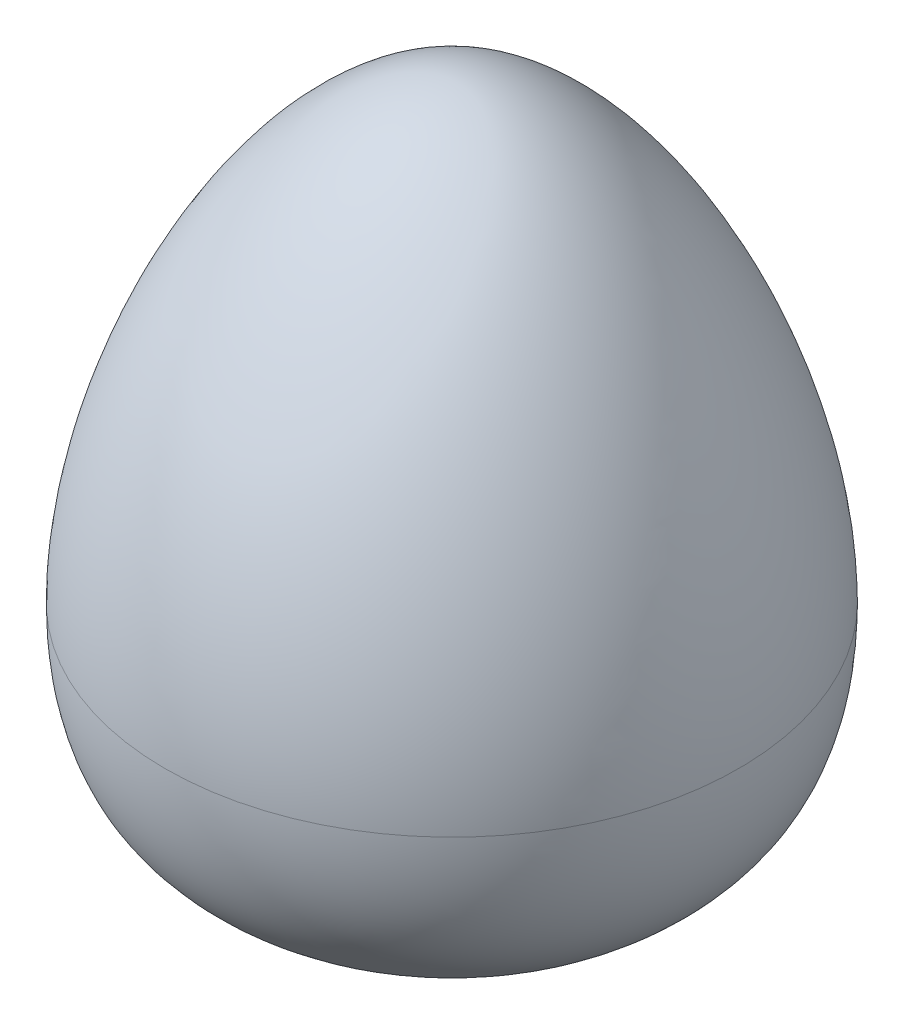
from build123d import *


with BuildPart() as part:
    # Sketch1 → Revolve1 (revolve)
    with BuildSketch(Plane.XY):
        with BuildLine():
            Line((0, 0), (0, 77.043433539))
            add(Edge.make_bspline(
                [(0, 77.043433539), (-20.002901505, 77.043433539), (-50.248034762, 8.802193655), (-9.980106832, 0), (0, 0)],
                knots=[0, 0, 0, 0, 0.661391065, 1, 1, 1, 1], degree=3))
        make_face()
    revolve(axis=Axis((0, 0, 0), (0, 1, 0)))


solid = part.part
